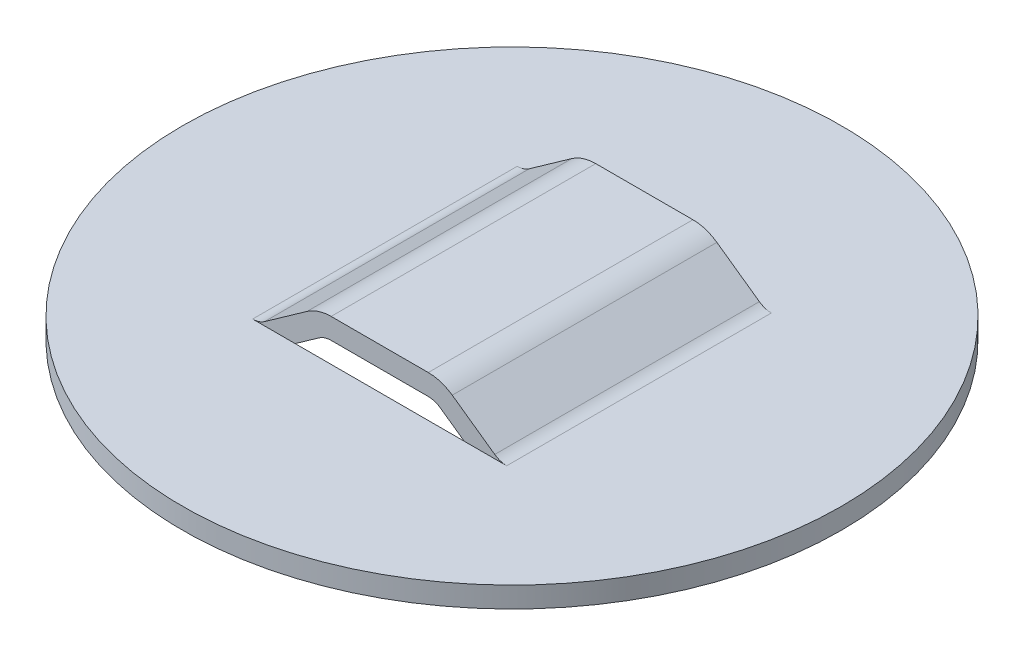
ISO-10303-21;
HEADER;
FILE_DESCRIPTION(('STEP AP214'),'2;1');
FILE_NAME('part.step','',(''),(''),'','','');
FILE_SCHEMA(('AUTOMOTIVE_DESIGN { 1 0 10303 214 1 1 1 1 }'));
ENDSEC;
DATA;
#1=APPLICATION_CONTEXT('core data for automotive mechanical design processes');
#2=APPLICATION_PROTOCOL_DEFINITION('international standard','automotive_design',2000,#1);
#3=PRODUCT_CONTEXT('',#1,'mechanical');
#4=PRODUCT('Part','Part','',(#3));
#5=PRODUCT_RELATED_PRODUCT_CATEGORY('part','',(#4));
#6=PRODUCT_DEFINITION_FORMATION('','',#4);
#7=PRODUCT_DEFINITION_CONTEXT('part definition',#1,'design');
#8=PRODUCT_DEFINITION('design','',#6,#7);
#9=PRODUCT_DEFINITION_SHAPE('','',#8);
#10=(LENGTH_UNIT() NAMED_UNIT(*) SI_UNIT(.MILLI.,.METRE.));
#11=(NAMED_UNIT(*) PLANE_ANGLE_UNIT() SI_UNIT($,.RADIAN.));
#12=(NAMED_UNIT(*) SI_UNIT($,.STERADIAN.) SOLID_ANGLE_UNIT());
#13=UNCERTAINTY_MEASURE_WITH_UNIT(LENGTH_MEASURE(1.E-05),#10,'distance_accuracy_value','');
#14=(GEOMETRIC_REPRESENTATION_CONTEXT(3) GLOBAL_UNCERTAINTY_ASSIGNED_CONTEXT((#13)) GLOBAL_UNIT_ASSIGNED_CONTEXT((#10,
#11,#12)) REPRESENTATION_CONTEXT('',''));
#15=CARTESIAN_POINT('',(0.,0.,0.));
#16=DIRECTION('',(0.,0.,1.));
#17=DIRECTION('',(1.,0.,0.));
#18=AXIS2_PLACEMENT_3D('',#15,#16,#17);
#19=CARTESIAN_POINT('',(3.74440314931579,1.6002,20.3962));
#20=DIRECTION('',(0.,1.,0.));
#21=DIRECTION('',(-1.,0.,0.));
#22=AXIS2_PLACEMENT_3D('',#19,#20,#21);
#23=PLANE('',#22);
#24=DIRECTION('',(0.,0.,-1.));
#25=VECTOR('',#24,1.);
#26=CARTESIAN_POINT('',(3.74440314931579,1.6002,20.3962));
#27=LINE('',#26,#25);
#28=CARTESIAN_POINT('',(3.74440314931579,1.6002,0.));
#29=VERTEX_POINT('',#28);
#30=CARTESIAN_POINT('',(3.74440314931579,1.6002,20.3962));
#31=VERTEX_POINT('',#30);
#32=EDGE_CURVE('E153',#29,#31,#27,.F.);
#33=ORIENTED_EDGE('',*,*,#32,.T.);
#34=DIRECTION('',(1.,0.,0.));
#35=VECTOR('',#34,1.);
#36=CARTESIAN_POINT('',(-9.7927484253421,1.6002,20.3962));
#37=LINE('',#36,#35);
#38=CARTESIAN_POINT('',(-3.74440314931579,1.6002,20.3962));
#39=VERTEX_POINT('',#38);
#40=EDGE_CURVE('E155',#39,#31,#37,.T.);
#41=ORIENTED_EDGE('',*,*,#40,.F.);
#42=DIRECTION('',(0.,0.,-1.));
#43=VECTOR('',#42,1.);
#44=CARTESIAN_POINT('',(-3.74440314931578,1.6002,20.3962));
#45=LINE('',#44,#43);
#46=CARTESIAN_POINT('',(-3.74440314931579,1.6002,0.));
#47=VERTEX_POINT('',#46);
#48=EDGE_CURVE('E157',#39,#47,#45,.T.);
#49=ORIENTED_EDGE('',*,*,#48,.T.);
#50=DIRECTION('',(1.,0.,0.));
#51=VECTOR('',#50,1.);
#52=CARTESIAN_POINT('',(-9.7927484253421,1.6002,0.));
#53=LINE('',#52,#51);
#54=EDGE_CURVE('E207',#47,#29,#53,.T.);
#55=ORIENTED_EDGE('',*,*,#54,.T.);
#56=EDGE_LOOP('',(#33,#41,#49,#55));
#57=FACE_BOUND('',#56,.T.);
#58=ADVANCED_FACE('F18',(#57),#23,.F.);
#59=CARTESIAN_POINT('',(8.86821229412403,0.294109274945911,20.3962));
#60=DIRECTION('',(-0.577762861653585,-0.816204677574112,0.));
#61=DIRECTION('',(0.816204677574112,-0.577762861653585,0.));
#62=AXIS2_PLACEMENT_3D('',#59,#60,#61);
#63=PLANE('',#62);
#64=DIRECTION('',(0.,0.,-1.));
#65=VECTOR('',#64,1.);
#66=CARTESIAN_POINT('',(5.59347541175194,2.61218145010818,20.3962));
#67=LINE('',#66,#65);
#68=CARTESIAN_POINT('',(5.59347541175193,2.61218145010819,20.3962));
#69=VERTEX_POINT('',#68);
#70=CARTESIAN_POINT('',(5.59347541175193,2.61218145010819,0.));
#71=VERTEX_POINT('',#70);
#72=EDGE_CURVE('E241',#69,#71,#67,.T.);
#73=ORIENTED_EDGE('',*,*,#72,.F.);
#74=DIRECTION('',(-0.816204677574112,0.577762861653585,0.));
#75=VECTOR('',#74,1.);
#76=CARTESIAN_POINT('',(8.86821229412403,0.294109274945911,20.3962));
#77=LINE('',#76,#75);
#78=CARTESIAN_POINT('',(8.86821229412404,0.294109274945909,20.3962));
#79=VERTEX_POINT('',#78);
#80=EDGE_CURVE('E214',#79,#69,#77,.T.);
#81=ORIENTED_EDGE('',*,*,#80,.F.);
#82=DIRECTION('',(0.,0.,-1.));
#83=VECTOR('',#82,1.);
#84=CARTESIAN_POINT('',(8.86821229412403,0.29410927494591,20.3962));
#85=LINE('',#84,#83);
#86=CARTESIAN_POINT('',(8.86821229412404,0.294109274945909,0.));
#87=VERTEX_POINT('',#86);
#88=EDGE_CURVE('E135',#79,#87,#85,.T.);
#89=ORIENTED_EDGE('',*,*,#88,.T.);
#90=DIRECTION('',(-0.816204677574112,0.577762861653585,0.));
#91=VECTOR('',#90,1.);
#92=CARTESIAN_POINT('',(8.86821229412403,0.294109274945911,0.));
#93=LINE('',#92,#91);
#94=EDGE_CURVE('E200',#87,#71,#93,.T.);
#95=ORIENTED_EDGE('',*,*,#94,.T.);
#96=EDGE_LOOP('',(#73,#81,#89,#95));
#97=FACE_BOUND('',#96,.T.);
#98=ADVANCED_FACE('F256',(#97),#63,.F.);
#99=CARTESIAN_POINT('',(3.74440314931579,0.,20.3962));
#100=DIRECTION('',(0.,0.,-1.));
#101=DIRECTION('',(-1.,0.,0.));
#102=AXIS2_PLACEMENT_3D('',#99,#100,#101);
#103=CYLINDRICAL_SURFACE('',#102,3.2004);
#104=CARTESIAN_POINT('',(3.74440314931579,0.,20.3962));
#105=DIRECTION('',(0.,0.,-1.));
#106=DIRECTION('',(-1.,0.,0.));
#107=AXIS2_PLACEMENT_3D('',#104,#105,#106);
#108=CIRCLE('',#107,3.2004);
#109=CARTESIAN_POINT('',(3.74440314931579,3.2004,20.3962));
#110=VERTEX_POINT('',#109);
#111=EDGE_CURVE('E212',#69,#110,#108,.F.);
#112=ORIENTED_EDGE('',*,*,#111,.F.);
#113=ORIENTED_EDGE('',*,*,#72,.T.);
#114=CARTESIAN_POINT('',(3.74440314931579,0.,0.));
#115=DIRECTION('',(0.,0.,-1.));
#116=DIRECTION('',(-1.,0.,0.));
#117=AXIS2_PLACEMENT_3D('',#114,#115,#116);
#118=CIRCLE('',#117,3.2004);
#119=CARTESIAN_POINT('',(3.74440314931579,3.2004,0.));
#120=VERTEX_POINT('',#119);
#121=EDGE_CURVE('E197',#71,#120,#118,.F.);
#122=ORIENTED_EDGE('',*,*,#121,.T.);
#123=DIRECTION('',(0.,0.,-1.));
#124=VECTOR('',#123,1.);
#125=CARTESIAN_POINT('',(3.74440314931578,3.2004,20.3962));
#126=LINE('',#125,#124);
#127=EDGE_CURVE('E239',#120,#110,#126,.F.);
#128=ORIENTED_EDGE('',*,*,#127,.T.);
#129=EDGE_LOOP('',(#112,#113,#122,#128));
#130=FACE_BOUND('',#129,.T.);
#131=ADVANCED_FACE('F246',(#130),#103,.T.);
#132=CARTESIAN_POINT('',(-3.74440314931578,3.2004,20.3962));
#133=DIRECTION('',(0.,-1.,0.));
#134=DIRECTION('',(0.,0.,-1.));
#135=AXIS2_PLACEMENT_3D('',#132,#133,#134);
#136=PLANE('',#135);
#137=DIRECTION('',(0.,0.,-1.));
#138=VECTOR('',#137,1.);
#139=CARTESIAN_POINT('',(-3.74440314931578,3.2004,20.3962));
#140=LINE('',#139,#138);
#141=CARTESIAN_POINT('',(-3.74440314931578,3.2004,20.3962));
#142=VERTEX_POINT('',#141);
#143=CARTESIAN_POINT('',(-3.74440314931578,3.2004,0.));
#144=VERTEX_POINT('',#143);
#145=EDGE_CURVE('E237',#142,#144,#140,.T.);
#146=ORIENTED_EDGE('',*,*,#145,.F.);
#147=DIRECTION('',(1.,0.,0.));
#148=VECTOR('',#147,1.);
#149=CARTESIAN_POINT('',(-9.7927484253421,3.2004,20.3962));
#150=LINE('',#149,#148);
#151=EDGE_CURVE('E211',#110,#142,#150,.F.);
#152=ORIENTED_EDGE('',*,*,#151,.F.);
#153=ORIENTED_EDGE('',*,*,#127,.F.);
#154=DIRECTION('',(1.,0.,0.));
#155=VECTOR('',#154,1.);
#156=CARTESIAN_POINT('',(-9.7927484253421,3.2004,0.));
#157=LINE('',#156,#155);
#158=EDGE_CURVE('E196',#120,#144,#157,.F.);
#159=ORIENTED_EDGE('',*,*,#158,.T.);
#160=EDGE_LOOP('',(#146,#152,#153,#159));
#161=FACE_BOUND('',#160,.T.);
#162=ADVANCED_FACE('F269',(#161),#136,.F.);
#163=CARTESIAN_POINT('',(-3.74440314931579,0.,20.3962));
#164=DIRECTION('',(0.,0.,-1.));
#165=DIRECTION('',(-1.,0.,0.));
#166=AXIS2_PLACEMENT_3D('',#163,#164,#165);
#167=CYLINDRICAL_SURFACE('',#166,3.2004);
#168=CARTESIAN_POINT('',(-3.74440314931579,0.,20.3962));
#169=DIRECTION('',(0.,0.,-1.));
#170=DIRECTION('',(-1.,0.,0.));
#171=AXIS2_PLACEMENT_3D('',#168,#169,#170);
#172=CIRCLE('',#171,3.2004);
#173=CARTESIAN_POINT('',(-5.59347541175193,2.61218145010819,20.3962));
#174=VERTEX_POINT('',#173);
#175=EDGE_CURVE('E144',#142,#174,#172,.F.);
#176=ORIENTED_EDGE('',*,*,#175,.F.);
#177=ORIENTED_EDGE('',*,*,#145,.T.);
#178=CARTESIAN_POINT('',(-3.74440314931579,0.,0.));
#179=DIRECTION('',(0.,0.,-1.));
#180=DIRECTION('',(-1.,0.,0.));
#181=AXIS2_PLACEMENT_3D('',#178,#179,#180);
#182=CIRCLE('',#181,3.2004);
#183=CARTESIAN_POINT('',(-5.59347541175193,2.61218145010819,0.));
#184=VERTEX_POINT('',#183);
#185=EDGE_CURVE('E193',#144,#184,#182,.F.);
#186=ORIENTED_EDGE('',*,*,#185,.T.);
#187=DIRECTION('',(0.,0.,1.));
#188=VECTOR('',#187,1.);
#189=CARTESIAN_POINT('',(-5.59347541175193,2.61218145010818,20.3962));
#190=LINE('',#189,#188);
#191=EDGE_CURVE('E136',#184,#174,#190,.T.);
#192=ORIENTED_EDGE('',*,*,#191,.T.);
#193=EDGE_LOOP('',(#176,#177,#186,#192));
#194=FACE_BOUND('',#193,.T.);
#195=ADVANCED_FACE('F271',(#194),#167,.T.);
#196=CARTESIAN_POINT('',(-8.86821229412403,0.294109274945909,20.3962));
#197=DIRECTION('',(0.577762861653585,-0.816204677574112,0.));
#198=DIRECTION('',(0.816204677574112,0.577762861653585,0.));
#199=AXIS2_PLACEMENT_3D('',#196,#197,#198);
#200=PLANE('',#199);
#201=DIRECTION('',(0.,0.,-1.));
#202=VECTOR('',#201,1.);
#203=CARTESIAN_POINT('',(-8.86821229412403,0.294109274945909,20.3962));
#204=LINE('',#203,#202);
#205=CARTESIAN_POINT('',(-8.86821229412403,0.294109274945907,0.));
#206=VERTEX_POINT('',#205);
#207=CARTESIAN_POINT('',(-8.86821229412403,0.294109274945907,20.3962));
#208=VERTEX_POINT('',#207);
#209=EDGE_CURVE('E126',#206,#208,#204,.F.);
#210=ORIENTED_EDGE('',*,*,#209,.T.);
#211=DIRECTION('',(-0.816204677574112,-0.577762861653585,0.));
#212=VECTOR('',#211,1.);
#213=CARTESIAN_POINT('',(-5.59347541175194,2.61218145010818,20.3962));
#214=LINE('',#213,#212);
#215=EDGE_CURVE('E129',#174,#208,#214,.T.);
#216=ORIENTED_EDGE('',*,*,#215,.F.);
#217=ORIENTED_EDGE('',*,*,#191,.F.);
#218=DIRECTION('',(-0.816204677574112,-0.577762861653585,0.));
#219=VECTOR('',#218,1.);
#220=CARTESIAN_POINT('',(-5.59347541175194,2.61218145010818,0.));
#221=LINE('',#220,#219);
#222=EDGE_CURVE('E131',#184,#206,#221,.T.);
#223=ORIENTED_EDGE('',*,*,#222,.T.);
#224=EDGE_LOOP('',(#210,#216,#217,#223));
#225=FACE_BOUND('',#224,.T.);
#226=ADVANCED_FACE('F128',(#225),#200,.F.);
#227=CARTESIAN_POINT('',(-9.7927484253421,1.6002,20.3962));
#228=DIRECTION('',(0.,0.,-1.));
#229=DIRECTION('',(-1.,0.,0.));
#230=AXIS2_PLACEMENT_3D('',#227,#228,#229);
#231=CYLINDRICAL_SURFACE('',#230,1.6002);
#232=DIRECTION('',(0.,0.,-1.));
#233=VECTOR('',#232,1.);
#234=CARTESIAN_POINT('',(-9.79274842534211,0.,20.3962));
#235=LINE('',#234,#233);
#236=CARTESIAN_POINT('',(-9.79274842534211,0.,0.));
#237=VERTEX_POINT('',#236);
#238=CARTESIAN_POINT('',(-9.79274842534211,0.,20.3962));
#239=VERTEX_POINT('',#238);
#240=EDGE_CURVE('E151',#237,#239,#235,.F.);
#241=ORIENTED_EDGE('',*,*,#240,.T.);
#242=CARTESIAN_POINT('',(-9.7927484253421,1.6002,20.3962));
#243=DIRECTION('',(0.,0.,-1.));
#244=DIRECTION('',(-1.,0.,0.));
#245=AXIS2_PLACEMENT_3D('',#242,#243,#244);
#246=CIRCLE('',#245,1.6002);
#247=EDGE_CURVE('E21',#208,#239,#246,.T.);
#248=ORIENTED_EDGE('',*,*,#247,.F.);
#249=ORIENTED_EDGE('',*,*,#209,.F.);
#250=CARTESIAN_POINT('',(-9.7927484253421,1.6002,0.));
#251=DIRECTION('',(0.,0.,-1.));
#252=DIRECTION('',(-1.,0.,0.));
#253=AXIS2_PLACEMENT_3D('',#250,#251,#252);
#254=CIRCLE('',#253,1.6002);
#255=EDGE_CURVE('E190',#206,#237,#254,.T.);
#256=ORIENTED_EDGE('',*,*,#255,.T.);
#257=EDGE_LOOP('',(#241,#248,#249,#256));
#258=FACE_BOUND('',#257,.T.);
#259=ADVANCED_FACE('F149',(#258),#231,.F.);
#260=CARTESIAN_POINT('',(9.7927484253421,1.6002,20.3962));
#261=DIRECTION('',(0.,0.,-1.));
#262=DIRECTION('',(-1.,0.,0.));
#263=AXIS2_PLACEMENT_3D('',#260,#261,#262);
#264=CYLINDRICAL_SURFACE('',#263,1.6002);
#265=ORIENTED_EDGE('',*,*,#88,.F.);
#266=CARTESIAN_POINT('',(9.7927484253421,1.6002,20.3962));
#267=DIRECTION('',(0.,0.,-1.));
#268=DIRECTION('',(-1.,0.,0.));
#269=AXIS2_PLACEMENT_3D('',#266,#267,#268);
#270=CIRCLE('',#269,1.6002);
#271=CARTESIAN_POINT('',(9.79274842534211,0.,20.3962));
#272=VERTEX_POINT('',#271);
#273=EDGE_CURVE('E215',#272,#79,#270,.T.);
#274=ORIENTED_EDGE('',*,*,#273,.F.);
#275=DIRECTION('',(0.,0.,-1.));
#276=VECTOR('',#275,1.);
#277=CARTESIAN_POINT('',(9.79274842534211,0.,20.3962));
#278=LINE('',#277,#276);
#279=CARTESIAN_POINT('',(9.79274842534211,0.,0.));
#280=VERTEX_POINT('',#279);
#281=EDGE_CURVE('E230',#272,#280,#278,.T.);
#282=ORIENTED_EDGE('',*,*,#281,.T.);
#283=CARTESIAN_POINT('',(9.7927484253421,1.6002,0.));
#284=DIRECTION('',(0.,0.,-1.));
#285=DIRECTION('',(-1.,0.,0.));
#286=AXIS2_PLACEMENT_3D('',#283,#284,#285);
#287=CIRCLE('',#286,1.6002);
#288=EDGE_CURVE('E201',#280,#87,#287,.T.);
#289=ORIENTED_EDGE('',*,*,#288,.T.);
#290=EDGE_LOOP('',(#265,#274,#282,#289));
#291=FACE_BOUND('',#290,.T.);
#292=ADVANCED_FACE('F491',(#291),#264,.F.);
#293=CARTESIAN_POINT('',(-3.74440314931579,0.,20.3962));
#294=DIRECTION('',(0.,0.,-1.));
#295=DIRECTION('',(-1.,0.,0.));
#296=AXIS2_PLACEMENT_3D('',#293,#294,#295);
#297=CYLINDRICAL_SURFACE('',#296,1.6002);
#298=ORIENTED_EDGE('',*,*,#48,.F.);
#299=CARTESIAN_POINT('',(-3.74440314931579,0.,20.3962));
#300=DIRECTION('',(0.,0.,-1.));
#301=DIRECTION('',(-1.,0.,0.));
#302=AXIS2_PLACEMENT_3D('',#299,#300,#301);
#303=CIRCLE('',#302,1.6002);
#304=CARTESIAN_POINT('',(-4.66893928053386,1.30609072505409,20.3962));
#305=VERTEX_POINT('',#304);
#306=EDGE_CURVE('E152',#305,#39,#303,.T.);
#307=ORIENTED_EDGE('',*,*,#306,.F.);
#308=DIRECTION('',(0.,0.,1.));
#309=VECTOR('',#308,1.);
#310=CARTESIAN_POINT('',(-4.66893928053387,1.30609072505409,20.3962));
#311=LINE('',#310,#309);
#312=CARTESIAN_POINT('',(-4.66893928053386,1.30609072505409,0.));
#313=VERTEX_POINT('',#312);
#314=EDGE_CURVE('E225',#305,#313,#311,.F.);
#315=ORIENTED_EDGE('',*,*,#314,.T.);
#316=CARTESIAN_POINT('',(-3.74440314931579,0.,0.));
#317=DIRECTION('',(0.,0.,-1.));
#318=DIRECTION('',(-1.,0.,0.));
#319=AXIS2_PLACEMENT_3D('',#316,#317,#318);
#320=CIRCLE('',#319,1.6002);
#321=EDGE_CURVE('E146',#313,#47,#320,.T.);
#322=ORIENTED_EDGE('',*,*,#321,.T.);
#323=EDGE_LOOP('',(#298,#307,#315,#322));
#324=FACE_BOUND('',#323,.T.);
#325=ADVANCED_FACE('F482',(#324),#297,.F.);
#326=CARTESIAN_POINT('',(3.74440314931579,0.,20.3962));
#327=DIRECTION('',(0.,0.,-1.));
#328=DIRECTION('',(-1.,0.,0.));
#329=AXIS2_PLACEMENT_3D('',#326,#327,#328);
#330=CYLINDRICAL_SURFACE('',#329,1.6002);
#331=DIRECTION('',(0.,0.,1.));
#332=VECTOR('',#331,1.);
#333=CARTESIAN_POINT('',(4.66893928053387,1.30609072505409,20.3962));
#334=LINE('',#333,#332);
#335=CARTESIAN_POINT('',(4.66893928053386,1.30609072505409,0.));
#336=VERTEX_POINT('',#335);
#337=CARTESIAN_POINT('',(4.66893928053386,1.30609072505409,20.3962));
#338=VERTEX_POINT('',#337);
#339=EDGE_CURVE('E262',#336,#338,#334,.T.);
#340=ORIENTED_EDGE('',*,*,#339,.T.);
#341=CARTESIAN_POINT('',(3.74440314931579,0.,20.3962));
#342=DIRECTION('',(0.,0.,-1.));
#343=DIRECTION('',(-1.,0.,0.));
#344=AXIS2_PLACEMENT_3D('',#341,#342,#343);
#345=CIRCLE('',#344,1.6002);
#346=EDGE_CURVE('E218',#31,#338,#345,.T.);
#347=ORIENTED_EDGE('',*,*,#346,.F.);
#348=ORIENTED_EDGE('',*,*,#32,.F.);
#349=CARTESIAN_POINT('',(3.74440314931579,0.,0.));
#350=DIRECTION('',(0.,0.,-1.));
#351=DIRECTION('',(-1.,0.,0.));
#352=AXIS2_PLACEMENT_3D('',#349,#350,#351);
#353=CIRCLE('',#352,1.6002);
#354=EDGE_CURVE('E204',#29,#336,#353,.T.);
#355=ORIENTED_EDGE('',*,*,#354,.T.);
#356=EDGE_LOOP('',(#340,#347,#348,#355));
#357=FACE_BOUND('',#356,.T.);
#358=ADVANCED_FACE('F474',(#357),#330,.F.);
#359=CARTESIAN_POINT('',(-9.7927484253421,1.6002,20.3962));
#360=DIRECTION('',(0.,0.,1.));
#361=DIRECTION('',(1.,0.,0.));
#362=AXIS2_PLACEMENT_3D('',#359,#360,#361);
#363=PLANE('',#362);
#364=ORIENTED_EDGE('',*,*,#175,.T.);
#365=ORIENTED_EDGE('',*,*,#215,.T.);
#366=ORIENTED_EDGE('',*,*,#247,.T.);
#367=DIRECTION('',(1.,0.,0.));
#368=VECTOR('',#367,1.);
#369=CARTESIAN_POINT('',(-21.9023213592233,0.,20.3962));
#370=LINE('',#369,#368);
#371=CARTESIAN_POINT('',(-6.51405157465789,0.,20.3962));
#372=VERTEX_POINT('',#371);
#373=EDGE_CURVE('E234',#239,#372,#370,.T.);
#374=ORIENTED_EDGE('',*,*,#373,.T.);
#375=DIRECTION('',(-0.816204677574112,-0.577762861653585,0.));
#376=VECTOR('',#375,1.);
#377=CARTESIAN_POINT('',(-7.94367616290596,-1.01198145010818,20.3962));
#378=LINE('',#377,#376);
#379=EDGE_CURVE('E265',#372,#305,#378,.F.);
#380=ORIENTED_EDGE('',*,*,#379,.T.);
#381=ORIENTED_EDGE('',*,*,#306,.T.);
#382=ORIENTED_EDGE('',*,*,#40,.T.);
#383=ORIENTED_EDGE('',*,*,#346,.T.);
#384=DIRECTION('',(-0.816204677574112,0.577762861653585,0.));
#385=VECTOR('',#384,1.);
#386=CARTESIAN_POINT('',(7.94367616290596,-1.01198145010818,20.3962));
#387=LINE('',#386,#385);
#388=CARTESIAN_POINT('',(6.51405157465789,0.,20.3962));
#389=VERTEX_POINT('',#388);
#390=EDGE_CURVE('E264',#338,#389,#387,.F.);
#391=ORIENTED_EDGE('',*,*,#390,.T.);
#392=DIRECTION('',(1.,0.,0.));
#393=VECTOR('',#392,1.);
#394=CARTESIAN_POINT('',(-21.9023213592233,0.,20.3962));
#395=LINE('',#394,#393);
#396=EDGE_CURVE('E233',#389,#272,#395,.T.);
#397=ORIENTED_EDGE('',*,*,#396,.T.);
#398=ORIENTED_EDGE('',*,*,#273,.T.);
#399=ORIENTED_EDGE('',*,*,#80,.T.);
#400=ORIENTED_EDGE('',*,*,#111,.T.);
#401=ORIENTED_EDGE('',*,*,#151,.T.);
#402=EDGE_LOOP('',(#364,#365,#366,#374,#380,#381,#382,#383,#391,#397,#398,#399,#400,#401));
#403=FACE_BOUND('',#402,.T.);
#404=ADVANCED_FACE('F140',(#403),#363,.T.);
#405=CARTESIAN_POINT('',(-9.7927484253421,1.6002,0.));
#406=DIRECTION('',(0.,0.,1.));
#407=DIRECTION('',(1.,0.,0.));
#408=AXIS2_PLACEMENT_3D('',#405,#406,#407);
#409=PLANE('',#408);
#410=ORIENTED_EDGE('',*,*,#255,.F.);
#411=ORIENTED_EDGE('',*,*,#222,.F.);
#412=ORIENTED_EDGE('',*,*,#185,.F.);
#413=ORIENTED_EDGE('',*,*,#158,.F.);
#414=ORIENTED_EDGE('',*,*,#121,.F.);
#415=ORIENTED_EDGE('',*,*,#94,.F.);
#416=ORIENTED_EDGE('',*,*,#288,.F.);
#417=DIRECTION('',(1.,0.,0.));
#418=VECTOR('',#417,1.);
#419=CARTESIAN_POINT('',(-21.9023213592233,0.,0.));
#420=LINE('',#419,#418);
#421=CARTESIAN_POINT('',(6.51405157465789,0.,0.));
#422=VERTEX_POINT('',#421);
#423=EDGE_CURVE('E229',#280,#422,#420,.F.);
#424=ORIENTED_EDGE('',*,*,#423,.T.);
#425=DIRECTION('',(-0.816204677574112,0.577762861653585,0.));
#426=VECTOR('',#425,1.);
#427=CARTESIAN_POINT('',(7.94367616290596,-1.01198145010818,0.));
#428=LINE('',#427,#426);
#429=EDGE_CURVE('E189',#422,#336,#428,.T.);
#430=ORIENTED_EDGE('',*,*,#429,.T.);
#431=ORIENTED_EDGE('',*,*,#354,.F.);
#432=ORIENTED_EDGE('',*,*,#54,.F.);
#433=ORIENTED_EDGE('',*,*,#321,.F.);
#434=DIRECTION('',(-0.816204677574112,-0.577762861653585,0.));
#435=VECTOR('',#434,1.);
#436=CARTESIAN_POINT('',(-7.94367616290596,-1.01198145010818,0.));
#437=LINE('',#436,#435);
#438=CARTESIAN_POINT('',(-6.51405157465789,0.,0.));
#439=VERTEX_POINT('',#438);
#440=EDGE_CURVE('E228',#313,#439,#437,.T.);
#441=ORIENTED_EDGE('',*,*,#440,.T.);
#442=DIRECTION('',(1.,0.,0.));
#443=VECTOR('',#442,1.);
#444=CARTESIAN_POINT('',(-21.9023213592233,0.,0.));
#445=LINE('',#444,#443);
#446=EDGE_CURVE('E192',#439,#237,#445,.F.);
#447=ORIENTED_EDGE('',*,*,#446,.T.);
#448=EDGE_LOOP('',(#410,#411,#412,#413,#414,#415,#416,#424,#430,#431,#432,#433,#441,#447));
#449=FACE_BOUND('',#448,.T.);
#450=ADVANCED_FACE('F253',(#449),#409,.F.);
#451=CARTESIAN_POINT('',(-21.9023213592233,0.,20.3962));
#452=DIRECTION('',(0.,-1.,0.));
#453=DIRECTION('',(0.,0.,-1.));
#454=AXIS2_PLACEMENT_3D('',#451,#452,#453);
#455=PLANE('',#454);
#456=ORIENTED_EDGE('',*,*,#423,.F.);
#457=ORIENTED_EDGE('',*,*,#281,.F.);
#458=ORIENTED_EDGE('',*,*,#396,.F.);
#459=DIRECTION('',(1.,0.,0.));
#460=VECTOR('',#459,1.);
#461=CARTESIAN_POINT('',(9.7927484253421,0.,20.3962));
#462=LINE('',#461,#460);
#463=EDGE_CURVE('E287',#389,#372,#462,.F.);
#464=ORIENTED_EDGE('',*,*,#463,.T.);
#465=ORIENTED_EDGE('',*,*,#373,.F.);
#466=ORIENTED_EDGE('',*,*,#240,.F.);
#467=ORIENTED_EDGE('',*,*,#446,.F.);
#468=DIRECTION('',(1.,0.,0.));
#469=VECTOR('',#468,1.);
#470=CARTESIAN_POINT('',(9.7927484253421,0.,0.));
#471=LINE('',#470,#469);
#472=EDGE_CURVE('E306',#422,#439,#471,.F.);
#473=ORIENTED_EDGE('',*,*,#472,.F.);
#474=EDGE_LOOP('',(#456,#457,#458,#464,#465,#466,#467,#473));
#475=FACE_BOUND('',#474,.T.);
#476=CARTESIAN_POINT('',(0.,0.,10.1981));
#477=DIRECTION('',(0.,-1.,0.));
#478=DIRECTION('',(1.,0.,0.));
#479=AXIS2_PLACEMENT_3D('',#476,#477,#478);
#480=CIRCLE('',#479,25.4);
#481=CARTESIAN_POINT('',(25.4,0.,10.1981));
#482=VERTEX_POINT('',#481);
#483=EDGE_CURVE('E185',#482,#482,#480,.T.);
#484=ORIENTED_EDGE('',*,*,#483,.F.);
#485=EDGE_LOOP('',(#484));
#486=FACE_BOUND('',#485,.T.);
#487=ADVANCED_FACE('F349',(#475,#486),#455,.F.);
#488=CARTESIAN_POINT('',(-7.94367616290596,-1.01198145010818,20.3962));
#489=DIRECTION('',(-0.577762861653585,0.816204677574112,0.));
#490=DIRECTION('',(-0.816204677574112,-0.577762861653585,0.));
#491=AXIS2_PLACEMENT_3D('',#488,#489,#490);
#492=PLANE('',#491);
#493=DIRECTION('',(-0.816204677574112,-0.577762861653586,0.));
#494=VECTOR('',#493,1.);
#495=CARTESIAN_POINT('',(-6.5140515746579,0.,20.3962));
#496=LINE('',#495,#494);
#497=CARTESIAN_POINT('',(-7.94367616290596,-1.01198145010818,20.3962));
#498=VERTEX_POINT('',#497);
#499=EDGE_CURVE('E184',#372,#498,#496,.T.);
#500=ORIENTED_EDGE('',*,*,#499,.T.);
#501=DIRECTION('',(0.,0.,1.));
#502=VECTOR('',#501,1.);
#503=CARTESIAN_POINT('',(-7.94367616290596,-1.01198145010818,0.));
#504=LINE('',#503,#502);
#505=CARTESIAN_POINT('',(-7.94367616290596,-1.01198145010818,0.));
#506=VERTEX_POINT('',#505);
#507=EDGE_CURVE('E179',#506,#498,#504,.T.);
#508=ORIENTED_EDGE('',*,*,#507,.F.);
#509=DIRECTION('',(-0.816204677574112,-0.577762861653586,0.));
#510=VECTOR('',#509,1.);
#511=CARTESIAN_POINT('',(-6.5140515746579,0.,0.));
#512=LINE('',#511,#510);
#513=EDGE_CURVE('E176',#439,#506,#512,.T.);
#514=ORIENTED_EDGE('',*,*,#513,.F.);
#515=ORIENTED_EDGE('',*,*,#440,.F.);
#516=ORIENTED_EDGE('',*,*,#314,.F.);
#517=ORIENTED_EDGE('',*,*,#379,.F.);
#518=EDGE_LOOP('',(#500,#508,#514,#515,#516,#517));
#519=FACE_BOUND('',#518,.T.);
#520=ADVANCED_FACE('F358',(#519),#492,.F.);
#521=CARTESIAN_POINT('',(7.94367616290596,-1.01198145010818,20.3962));
#522=DIRECTION('',(0.577762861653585,0.816204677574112,0.));
#523=DIRECTION('',(-0.816204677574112,0.577762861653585,0.));
#524=AXIS2_PLACEMENT_3D('',#521,#522,#523);
#525=PLANE('',#524);
#526=DIRECTION('',(-0.816204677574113,0.577762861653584,0.));
#527=VECTOR('',#526,1.);
#528=CARTESIAN_POINT('',(7.94367616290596,-1.01198145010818,0.));
#529=LINE('',#528,#527);
#530=CARTESIAN_POINT('',(7.94367616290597,-1.01198145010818,0.));
#531=VERTEX_POINT('',#530);
#532=EDGE_CURVE('E171',#531,#422,#529,.T.);
#533=ORIENTED_EDGE('',*,*,#532,.F.);
#534=DIRECTION('',(0.,0.,1.));
#535=VECTOR('',#534,1.);
#536=CARTESIAN_POINT('',(7.94367616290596,-1.01198145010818,0.));
#537=LINE('',#536,#535);
#538=CARTESIAN_POINT('',(7.94367616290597,-1.01198145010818,20.3962));
#539=VERTEX_POINT('',#538);
#540=EDGE_CURVE('E188',#539,#531,#537,.F.);
#541=ORIENTED_EDGE('',*,*,#540,.F.);
#542=DIRECTION('',(-0.816204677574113,0.577762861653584,0.));
#543=VECTOR('',#542,1.);
#544=CARTESIAN_POINT('',(7.94367616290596,-1.01198145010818,20.3962));
#545=LINE('',#544,#543);
#546=EDGE_CURVE('E180',#539,#389,#545,.T.);
#547=ORIENTED_EDGE('',*,*,#546,.T.);
#548=ORIENTED_EDGE('',*,*,#390,.F.);
#549=ORIENTED_EDGE('',*,*,#339,.F.);
#550=ORIENTED_EDGE('',*,*,#429,.F.);
#551=EDGE_LOOP('',(#533,#541,#547,#548,#549,#550));
#552=FACE_BOUND('',#551,.T.);
#553=ADVANCED_FACE('F372',(#552),#525,.F.);
#554=CARTESIAN_POINT('',(0.,0.,10.1981));
#555=DIRECTION('',(0.,-1.,0.));
#556=DIRECTION('',(1.,0.,0.));
#557=AXIS2_PLACEMENT_3D('',#554,#555,#556);
#558=CYLINDRICAL_SURFACE('',#557,25.4);
#559=CARTESIAN_POINT('',(0.,-1.6002,10.1981));
#560=DIRECTION('',(0.,-1.,0.));
#561=DIRECTION('',(1.,0.,0.));
#562=AXIS2_PLACEMENT_3D('',#559,#560,#561);
#563=CIRCLE('',#562,25.4);
#564=CARTESIAN_POINT('',(25.4,-1.6002,10.1981));
#565=VERTEX_POINT('',#564);
#566=EDGE_CURVE('E167',#565,#565,#563,.F.);
#567=ORIENTED_EDGE('',*,*,#566,.T.);
#568=EDGE_LOOP('',(#567));
#569=FACE_BOUND('',#568,.T.);
#570=ORIENTED_EDGE('',*,*,#483,.T.);
#571=EDGE_LOOP('',(#570));
#572=FACE_BOUND('',#571,.T.);
#573=ADVANCED_FACE('F374',(#569,#572),#558,.T.);
#574=CARTESIAN_POINT('',(9.7927484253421,1.6002,0.));
#575=DIRECTION('',(0.,0.,1.));
#576=DIRECTION('',(1.,0.,0.));
#577=AXIS2_PLACEMENT_3D('',#574,#575,#576);
#578=CYLINDRICAL_SURFACE('',#577,3.2004);
#579=CARTESIAN_POINT('',(9.7927484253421,1.6002,0.));
#580=DIRECTION('',(0.,0.,1.));
#581=DIRECTION('',(1.,0.,0.));
#582=AXIS2_PLACEMENT_3D('',#579,#580,#581);
#583=CIRCLE('',#582,3.2004);
#584=CARTESIAN_POINT('',(9.79274842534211,-1.6002,0.));
#585=VERTEX_POINT('',#584);
#586=EDGE_CURVE('E172',#585,#531,#583,.F.);
#587=ORIENTED_EDGE('',*,*,#586,.F.);
#588=DIRECTION('',(0.,0.,1.));
#589=VECTOR('',#588,1.);
#590=CARTESIAN_POINT('',(9.79274842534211,-1.6002,20.3962));
#591=LINE('',#590,#589);
#592=CARTESIAN_POINT('',(9.79274842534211,-1.6002,20.3962));
#593=VERTEX_POINT('',#592);
#594=EDGE_CURVE('E170',#585,#593,#591,.T.);
#595=ORIENTED_EDGE('',*,*,#594,.T.);
#596=CARTESIAN_POINT('',(9.7927484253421,1.6002,20.3962));
#597=DIRECTION('',(0.,0.,1.));
#598=DIRECTION('',(1.,0.,0.));
#599=AXIS2_PLACEMENT_3D('',#596,#597,#598);
#600=CIRCLE('',#599,3.2004);
#601=EDGE_CURVE('E181',#593,#539,#600,.F.);
#602=ORIENTED_EDGE('',*,*,#601,.T.);
#603=ORIENTED_EDGE('',*,*,#540,.T.);
#604=EDGE_LOOP('',(#587,#595,#602,#603));
#605=FACE_BOUND('',#604,.T.);
#606=ADVANCED_FACE('F381',(#605),#578,.T.);
#607=CARTESIAN_POINT('',(9.7927484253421,1.6002,20.3962));
#608=DIRECTION('',(0.,0.,1.));
#609=DIRECTION('',(1.,0.,0.));
#610=AXIS2_PLACEMENT_3D('',#607,#608,#609);
#611=PLANE('',#610);
#612=ORIENTED_EDGE('',*,*,#601,.F.);
#613=DIRECTION('',(-1.,0.,0.));
#614=VECTOR('',#613,1.);
#615=CARTESIAN_POINT('',(21.9023213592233,-1.6002,20.3962));
#616=LINE('',#615,#614);
#617=CARTESIAN_POINT('',(-9.79274842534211,-1.6002,20.3962));
#618=VERTEX_POINT('',#617);
#619=EDGE_CURVE('E324',#593,#618,#616,.T.);
#620=ORIENTED_EDGE('',*,*,#619,.T.);
#621=CARTESIAN_POINT('',(-9.7927484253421,1.6002,20.3962));
#622=DIRECTION('',(0.,0.,1.));
#623=DIRECTION('',(1.,0.,0.));
#624=AXIS2_PLACEMENT_3D('',#621,#622,#623);
#625=CIRCLE('',#624,3.2004);
#626=EDGE_CURVE('E177',#498,#618,#625,.F.);
#627=ORIENTED_EDGE('',*,*,#626,.F.);
#628=ORIENTED_EDGE('',*,*,#499,.F.);
#629=ORIENTED_EDGE('',*,*,#463,.F.);
#630=ORIENTED_EDGE('',*,*,#546,.F.);
#631=EDGE_LOOP('',(#612,#620,#627,#628,#629,#630));
#632=FACE_BOUND('',#631,.T.);
#633=ADVANCED_FACE('F370',(#632),#611,.F.);
#634=CARTESIAN_POINT('',(-9.7927484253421,1.6002,0.));
#635=DIRECTION('',(0.,0.,1.));
#636=DIRECTION('',(1.,0.,0.));
#637=AXIS2_PLACEMENT_3D('',#634,#635,#636);
#638=CYLINDRICAL_SURFACE('',#637,3.2004);
#639=CARTESIAN_POINT('',(-9.7927484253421,1.6002,0.));
#640=DIRECTION('',(0.,0.,1.));
#641=DIRECTION('',(1.,0.,0.));
#642=AXIS2_PLACEMENT_3D('',#639,#640,#641);
#643=CIRCLE('',#642,3.2004);
#644=CARTESIAN_POINT('',(-9.79274842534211,-1.6002,0.));
#645=VERTEX_POINT('',#644);
#646=EDGE_CURVE('E35',#506,#645,#643,.F.);
#647=ORIENTED_EDGE('',*,*,#646,.F.);
#648=ORIENTED_EDGE('',*,*,#507,.T.);
#649=ORIENTED_EDGE('',*,*,#626,.T.);
#650=DIRECTION('',(0.,0.,1.));
#651=VECTOR('',#650,1.);
#652=CARTESIAN_POINT('',(-9.79274842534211,-1.6002,20.3962));
#653=LINE('',#652,#651);
#654=EDGE_CURVE('E27',#618,#645,#653,.F.);
#655=ORIENTED_EDGE('',*,*,#654,.T.);
#656=EDGE_LOOP('',(#647,#648,#649,#655));
#657=FACE_BOUND('',#656,.T.);
#658=ADVANCED_FACE('F392',(#657),#638,.T.);
#659=CARTESIAN_POINT('',(9.7927484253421,1.6002,0.));
#660=DIRECTION('',(0.,0.,1.));
#661=DIRECTION('',(1.,0.,0.));
#662=AXIS2_PLACEMENT_3D('',#659,#660,#661);
#663=PLANE('',#662);
#664=ORIENTED_EDGE('',*,*,#586,.T.);
#665=ORIENTED_EDGE('',*,*,#532,.T.);
#666=ORIENTED_EDGE('',*,*,#472,.T.);
#667=ORIENTED_EDGE('',*,*,#513,.T.);
#668=ORIENTED_EDGE('',*,*,#646,.T.);
#669=DIRECTION('',(-1.,0.,0.));
#670=VECTOR('',#669,1.);
#671=CARTESIAN_POINT('',(21.9023213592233,-1.6002,0.));
#672=LINE('',#671,#670);
#673=EDGE_CURVE('E11',#645,#585,#672,.F.);
#674=ORIENTED_EDGE('',*,*,#673,.T.);
#675=EDGE_LOOP('',(#664,#665,#666,#667,#668,#674));
#676=FACE_BOUND('',#675,.T.);
#677=ADVANCED_FACE('F339',(#676),#663,.T.);
#678=CARTESIAN_POINT('',(21.9023213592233,-1.6002,20.3962));
#679=DIRECTION('',(0.,1.,0.));
#680=DIRECTION('',(-1.,0.,0.));
#681=AXIS2_PLACEMENT_3D('',#678,#679,#680);
#682=PLANE('',#681);
#683=ORIENTED_EDGE('',*,*,#654,.F.);
#684=ORIENTED_EDGE('',*,*,#619,.F.);
#685=ORIENTED_EDGE('',*,*,#594,.F.);
#686=ORIENTED_EDGE('',*,*,#673,.F.);
#687=EDGE_LOOP('',(#683,#684,#685,#686));
#688=FACE_BOUND('',#687,.T.);
#689=ORIENTED_EDGE('',*,*,#566,.F.);
#690=EDGE_LOOP('',(#689));
#691=FACE_BOUND('',#690,.T.);
#692=ADVANCED_FACE('F385',(#688,#691),#682,.F.);
#693=CLOSED_SHELL('',(#58,#98,#131,#162,#195,#226,#259,#292,#325,#358,#404,#450,#487,#520,#553,
#573,#606,#633,#658,#677,#692));
#694=MANIFOLD_SOLID_BREP('B1',#693);
#695=ADVANCED_BREP_SHAPE_REPRESENTATION('',(#18,#694),#14);
#696=SHAPE_DEFINITION_REPRESENTATION(#9,#695);
ENDSEC;
END-ISO-10303-21;
